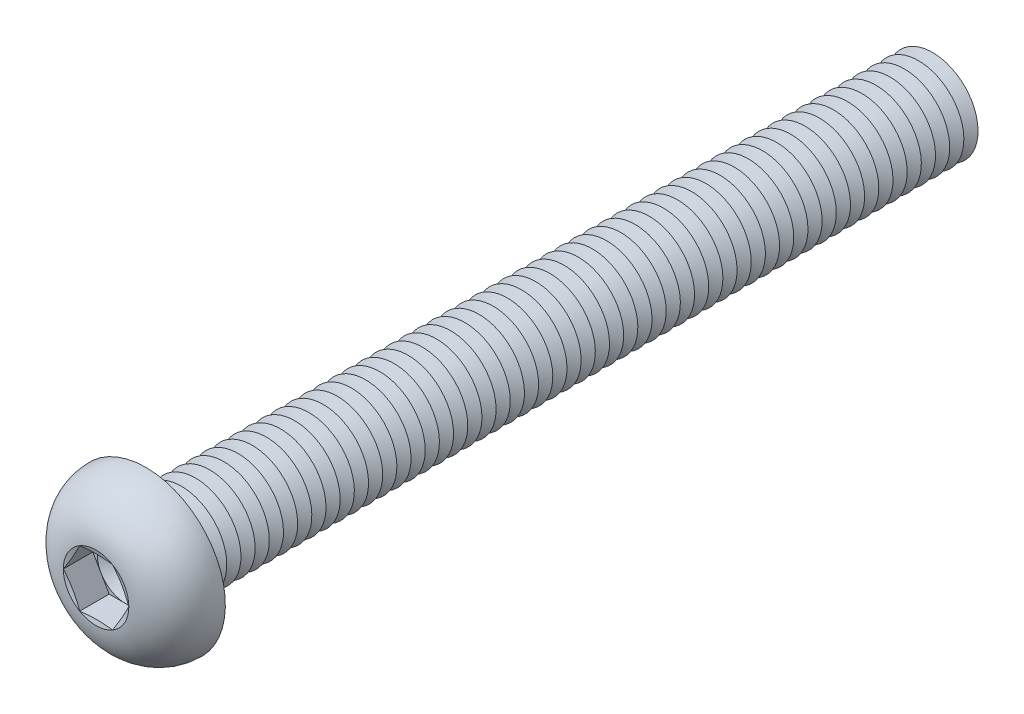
from build123d import *

# Parameters (mm, degrees)
FILLET1_R          = 0.625
LPATTERN1_COUNT    = 56
LPATTERN1_PITCH    = 1.25
CUT_EXTRUDE1_DEPTH = 2.6


with BuildPart() as part:
    # Sketch1 → Revolve1 (revolve)
    with BuildSketch(Plane(origin=(0, 0, 0), x_dir=(0, 0, -1), z_dir=(1, 0, 0))):
        with BuildLine():
            Line((0, 4), (0, 7))
            ThreePointArc((0, 7), (-3.011595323, 5.81154966), (-4.4, 2.88675))
            Line((-4.4, 2.88675), (-4.013248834, 1.443375))
            Line((-4.013248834, 1.443375), (-4.4, 1.443375))
            Line((-4.4, 1.443375), (-4.4, 0))
            Line((-4.4, 0), (70, 0))
            Line((70, 0), (70, 4))
            Line((70, 4), (0, 4))
        make_face()
    revolve(axis=Axis((0, 0, -70), (0, 0, 1)))

    # Fillet1
    fillet1_edges = [part.edges().sort_by_distance(p)[0] for p in [
        (0, -4, 0),
    ]]
    fillet(fillet1_edges, radius=FILLET1_R)

    # Sketch2 → Cut-Revolve1 (revolve, cut)
    with BuildSketch(Plane(origin=(0, 0, 0), x_dir=(0, 0, -1), z_dir=(1, 0, 0))):
        Polygon((69.375, 4), (70.625, 4), (70, 2.917468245), align=None)
    cut_revolve1 = revolve(axis=Axis((0, 0, -70), (0, 0, -1)), mode=Mode.SUBTRACT)

    # LPattern1: Cut-Revolve1 ×56
    with Locations(*[(0, 0, i * LPATTERN1_PITCH) for i in range(1, LPATTERN1_COUNT)]):
        add(cut_revolve1, mode=Mode.SUBTRACT)

    # Sketch3 → Cut-Extrude1 (cut)
    with BuildSketch(Plane.XY.offset(4.4)):
        Polygon((1.443375, 2.499998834), (-1.443375, 2.499998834), (-2.88675, 0), (-1.443375, -2.499998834), (1.443375, -2.499998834), (2.88675, 0), align=None)
    extrude(amount=-CUT_EXTRUDE1_DEPTH, mode=Mode.SUBTRACT)

    # Cut-Extrude2 cone 1 section (on through the dimple's axis) → Cut-Extrude2 (revolve, cut)
    with BuildSketch(Plane(origin=(0, 0, 1.8), x_dir=(0, -1, 0), z_dir=(1, 0, 0))):
        Polygon((0, 0), (2.499998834, 0), (0, 1.443375), align=None)
    revolve(axis=Axis((0, 0, 1.8), (0, 0, -1)), mode=Mode.SUBTRACT)


solid = part.part
